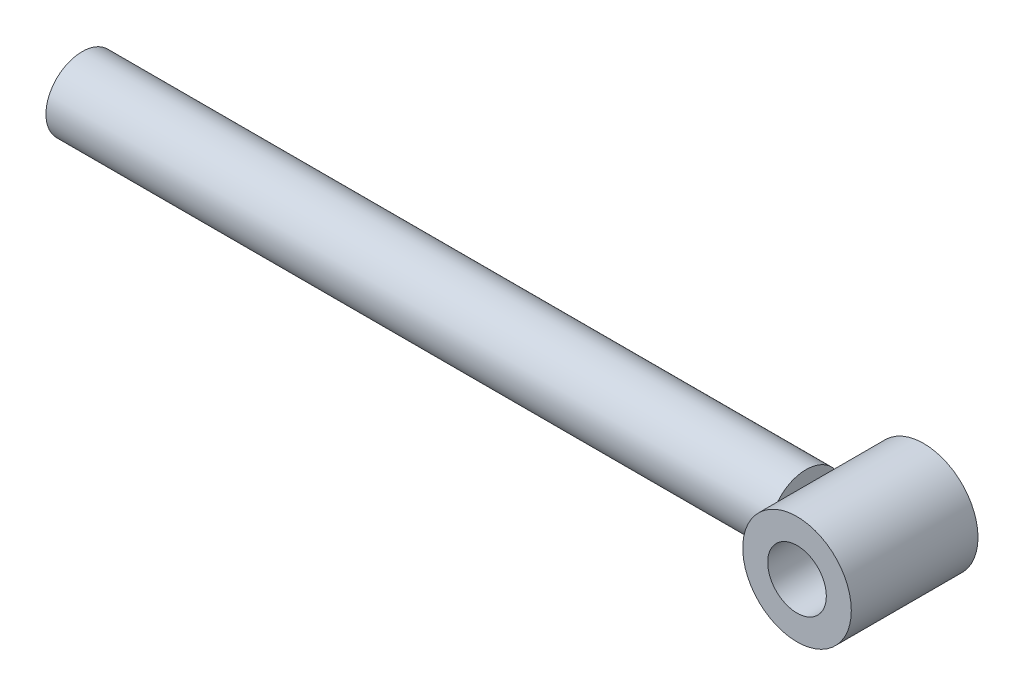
from build123d import *

# Parameters (mm, degrees)
ESQUISSE1_R      = 10
EXTRUSION1_DEPTH = 200
ESQUISSE2_R      = 15
ESQUISSE2_R_2    = 8.1
EXTRUSION2_DEPTH = 17.5


with BuildPart() as part:
    # Esquisse1 → Extrusion1 (new body)
    with BuildSketch(Plane(origin=(0, 0, 0), x_dir=(0, 0, -1), z_dir=(1, 0, 0))):
        Circle(ESQUISSE1_R)
    extrude(amount=EXTRUSION1_DEPTH)


with BuildPart() as body_2:
    # Esquisse2 → Extrusion2 (new, symmetric)
    with BuildSketch(Plane.XY):
        with Locations((215, 0)):
            Circle(ESQUISSE2_R)
        with Locations((215, 0)):
            Circle(ESQUISSE2_R_2, mode=Mode.SUBTRACT)
    extrude(amount=EXTRUSION2_DEPTH, both=True)


solid = Compound([part.part, body_2.part])
